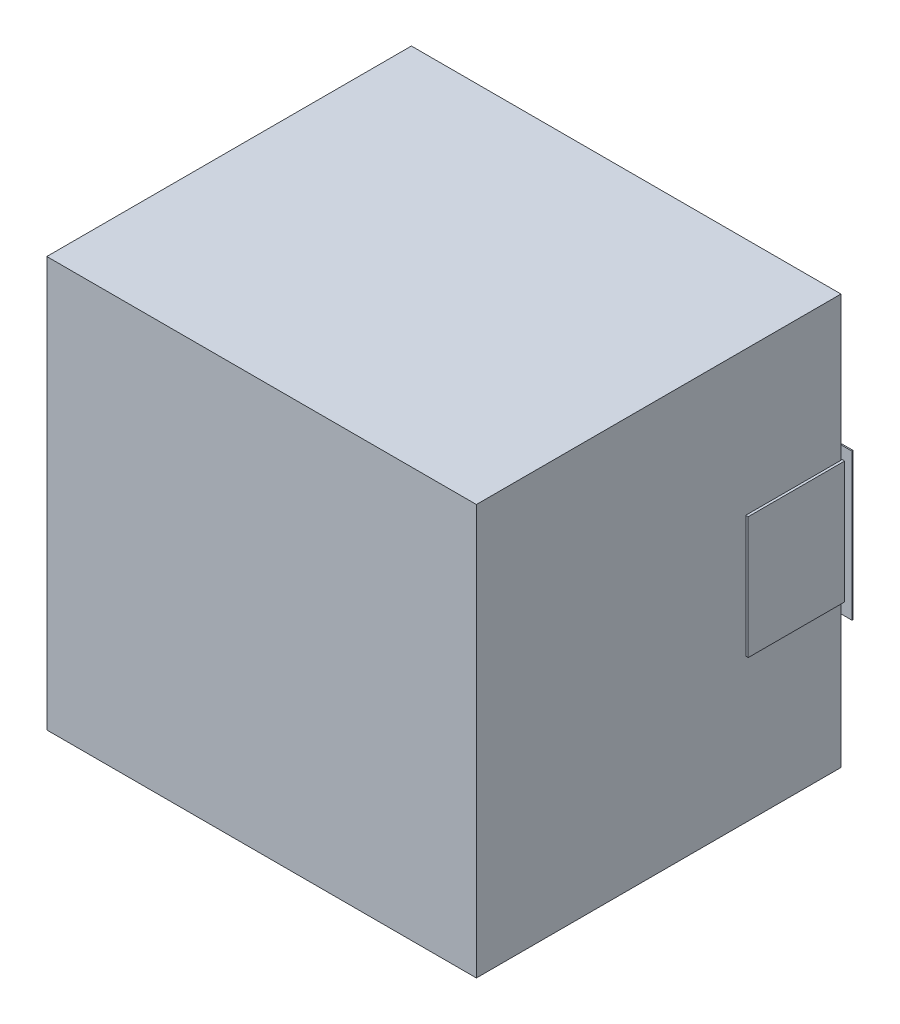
ISO-10303-21;
HEADER;
FILE_DESCRIPTION(('STEP AP214'),'2;1');
FILE_NAME('part.step','',(''),(''),'','','');
FILE_SCHEMA(('AUTOMOTIVE_DESIGN { 1 0 10303 214 1 1 1 1 }'));
ENDSEC;
DATA;
#1=APPLICATION_CONTEXT('core data for automotive mechanical design processes');
#2=APPLICATION_PROTOCOL_DEFINITION('international standard','automotive_design',2000,#1);
#3=PRODUCT_CONTEXT('',#1,'mechanical');
#4=PRODUCT('Part','Part','',(#3));
#5=PRODUCT_RELATED_PRODUCT_CATEGORY('part','',(#4));
#6=PRODUCT_DEFINITION_FORMATION('','',#4);
#7=PRODUCT_DEFINITION_CONTEXT('part definition',#1,'design');
#8=PRODUCT_DEFINITION('design','',#6,#7);
#9=PRODUCT_DEFINITION_SHAPE('','',#8);
#10=(LENGTH_UNIT() NAMED_UNIT(*) SI_UNIT(.MILLI.,.METRE.));
#11=(NAMED_UNIT(*) PLANE_ANGLE_UNIT() SI_UNIT($,.RADIAN.));
#12=(NAMED_UNIT(*) SI_UNIT($,.STERADIAN.) SOLID_ANGLE_UNIT());
#13=UNCERTAINTY_MEASURE_WITH_UNIT(LENGTH_MEASURE(1.E-05),#10,'distance_accuracy_value','');
#14=(GEOMETRIC_REPRESENTATION_CONTEXT(3) GLOBAL_UNCERTAINTY_ASSIGNED_CONTEXT((#13)) GLOBAL_UNIT_ASSIGNED_CONTEXT((#10,
#11,#12)) REPRESENTATION_CONTEXT('',''));
#15=CARTESIAN_POINT('',(0.,0.,0.));
#16=DIRECTION('',(0.,0.,1.));
#17=DIRECTION('',(1.,0.,0.));
#18=AXIS2_PLACEMENT_3D('',#15,#16,#17);
#19=CARTESIAN_POINT('',(0.,0.,0.0762));
#20=DIRECTION('',(0.,0.,-1.));
#21=DIRECTION('',(-1.,0.,0.));
#22=AXIS2_PLACEMENT_3D('',#19,#20,#21);
#23=PLANE('',#22);
#24=DIRECTION('',(1.,0.,0.));
#25=VECTOR('',#24,1.);
#26=CARTESIAN_POINT('',(-2.20000000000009,-1.5000000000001,0.0762));
#27=LINE('',#26,#25);
#28=CARTESIAN_POINT('',(-4.59999999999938,-1.5000000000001,0.0762));
#29=VERTEX_POINT('',#28);
#30=CARTESIAN_POINT('',(-2.20000000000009,-1.5000000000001,0.0762));
#31=VERTEX_POINT('',#30);
#32=EDGE_CURVE('E179',#29,#31,#27,.T.);
#33=ORIENTED_EDGE('',*,*,#32,.F.);
#34=DIRECTION('',(0.,1.,0.));
#35=VECTOR('',#34,1.);
#36=CARTESIAN_POINT('',(-4.59999999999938,-1.5000000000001,0.0762));
#37=LINE('',#36,#35);
#38=CARTESIAN_POINT('',(-4.59999999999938,1.5000000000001,0.0762));
#39=VERTEX_POINT('',#38);
#40=EDGE_CURVE('E19',#39,#29,#37,.F.);
#41=ORIENTED_EDGE('',*,*,#40,.F.);
#42=DIRECTION('',(1.,0.,0.));
#43=VECTOR('',#42,1.);
#44=CARTESIAN_POINT('',(-4.59999999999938,1.5000000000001,0.0762));
#45=LINE('',#44,#43);
#46=CARTESIAN_POINT('',(-2.20000000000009,1.5000000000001,0.0762));
#47=VERTEX_POINT('',#46);
#48=EDGE_CURVE('E174',#47,#39,#45,.F.);
#49=ORIENTED_EDGE('',*,*,#48,.F.);
#50=DIRECTION('',(0.,1.,0.));
#51=VECTOR('',#50,1.);
#52=CARTESIAN_POINT('',(-2.20000000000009,1.5000000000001,0.0762));
#53=LINE('',#52,#51);
#54=EDGE_CURVE('E194',#31,#47,#53,.T.);
#55=ORIENTED_EDGE('',*,*,#54,.F.);
#56=EDGE_LOOP('',(#33,#41,#49,#55));
#57=FACE_BOUND('',#56,.T.);
#58=ADVANCED_FACE('F16',(#57),#23,.T.);
#59=CARTESIAN_POINT('',(0.,0.,0.0762));
#60=DIRECTION('',(0.,0.,-1.));
#61=DIRECTION('',(-1.,0.,0.));
#62=AXIS2_PLACEMENT_3D('',#59,#60,#61);
#63=PLANE('',#62);
#64=DIRECTION('',(1.,0.,0.));
#65=VECTOR('',#64,1.);
#66=CARTESIAN_POINT('',(4.59999999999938,-1.5000000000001,0.0762));
#67=LINE('',#66,#65);
#68=CARTESIAN_POINT('',(2.20000000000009,-1.5000000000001,0.0762));
#69=VERTEX_POINT('',#68);
#70=CARTESIAN_POINT('',(4.59999999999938,-1.5000000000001,0.0762));
#71=VERTEX_POINT('',#70);
#72=EDGE_CURVE('E224',#69,#71,#67,.T.);
#73=ORIENTED_EDGE('',*,*,#72,.F.);
#74=DIRECTION('',(0.,1.,0.));
#75=VECTOR('',#74,1.);
#76=CARTESIAN_POINT('',(2.20000000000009,-1.5000000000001,0.0762));
#77=LINE('',#76,#75);
#78=CARTESIAN_POINT('',(2.20000000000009,1.5000000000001,0.0762));
#79=VERTEX_POINT('',#78);
#80=EDGE_CURVE('E204',#79,#69,#77,.F.);
#81=ORIENTED_EDGE('',*,*,#80,.F.);
#82=DIRECTION('',(1.,0.,0.));
#83=VECTOR('',#82,1.);
#84=CARTESIAN_POINT('',(2.20000000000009,1.5000000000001,0.0762));
#85=LINE('',#84,#83);
#86=CARTESIAN_POINT('',(4.59999999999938,1.5000000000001,0.0762));
#87=VERTEX_POINT('',#86);
#88=EDGE_CURVE('E209',#87,#79,#85,.F.);
#89=ORIENTED_EDGE('',*,*,#88,.F.);
#90=DIRECTION('',(0.,1.,0.));
#91=VECTOR('',#90,1.);
#92=CARTESIAN_POINT('',(4.59999999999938,1.5000000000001,0.0762));
#93=LINE('',#92,#91);
#94=EDGE_CURVE('E215',#71,#87,#93,.T.);
#95=ORIENTED_EDGE('',*,*,#94,.F.);
#96=EDGE_LOOP('',(#73,#81,#89,#95));
#97=FACE_BOUND('',#96,.T.);
#98=ADVANCED_FACE('F504',(#97),#63,.T.);
#99=CARTESIAN_POINT('',(-4.59999999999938,-1.5000000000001,0.0762));
#100=DIRECTION('',(-1.,0.,0.));
#101=DIRECTION('',(0.,0.,1.));
#102=AXIS2_PLACEMENT_3D('',#99,#100,#101);
#103=PLANE('',#102);
#104=DIRECTION('',(0.,0.,1.));
#105=VECTOR('',#104,1.);
#106=CARTESIAN_POINT('',(-4.59999999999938,1.5000000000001,0.0762));
#107=LINE('',#106,#105);
#108=CARTESIAN_POINT('',(-4.59999999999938,1.5000000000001,0.101200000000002));
#109=VERTEX_POINT('',#108);
#110=EDGE_CURVE('E182',#39,#109,#107,.T.);
#111=ORIENTED_EDGE('',*,*,#110,.F.);
#112=ORIENTED_EDGE('',*,*,#40,.T.);
#113=DIRECTION('',(0.,0.,-1.));
#114=VECTOR('',#113,1.);
#115=CARTESIAN_POINT('',(-4.59999999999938,-1.5000000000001,0.0762));
#116=LINE('',#115,#114);
#117=CARTESIAN_POINT('',(-4.59999999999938,-1.5000000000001,0.101200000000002));
#118=VERTEX_POINT('',#117);
#119=EDGE_CURVE('E201',#118,#29,#116,.T.);
#120=ORIENTED_EDGE('',*,*,#119,.F.);
#121=DIRECTION('',(0.,1.,0.));
#122=VECTOR('',#121,1.);
#123=CARTESIAN_POINT('',(-4.59999999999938,0.,0.101200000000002));
#124=LINE('',#123,#122);
#125=EDGE_CURVE('E186',#118,#109,#124,.T.);
#126=ORIENTED_EDGE('',*,*,#125,.T.);
#127=EDGE_LOOP('',(#111,#112,#120,#126));
#128=FACE_BOUND('',#127,.T.);
#129=ADVANCED_FACE('F184',(#128),#103,.T.);
#130=CARTESIAN_POINT('',(-4.59999999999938,1.5000000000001,0.0762));
#131=DIRECTION('',(0.,1.,0.));
#132=DIRECTION('',(0.,0.,1.));
#133=AXIS2_PLACEMENT_3D('',#130,#131,#132);
#134=PLANE('',#133);
#135=DIRECTION('',(0.,0.,-1.));
#136=VECTOR('',#135,1.);
#137=CARTESIAN_POINT('',(-2.20000000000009,1.5000000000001,0.0762));
#138=LINE('',#137,#136);
#139=CARTESIAN_POINT('',(-2.20000000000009,1.5000000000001,0.101200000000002));
#140=VERTEX_POINT('',#139);
#141=EDGE_CURVE('E191',#47,#140,#138,.F.);
#142=ORIENTED_EDGE('',*,*,#141,.F.);
#143=ORIENTED_EDGE('',*,*,#48,.T.);
#144=ORIENTED_EDGE('',*,*,#110,.T.);
#145=DIRECTION('',(-1.,0.,0.));
#146=VECTOR('',#145,1.);
#147=CARTESIAN_POINT('',(0.,1.5000000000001,0.101200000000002));
#148=LINE('',#147,#146);
#149=EDGE_CURVE('E228',#109,#140,#148,.F.);
#150=ORIENTED_EDGE('',*,*,#149,.T.);
#151=EDGE_LOOP('',(#142,#143,#144,#150));
#152=FACE_BOUND('',#151,.T.);
#153=ADVANCED_FACE('F189',(#152),#134,.T.);
#154=CARTESIAN_POINT('',(-2.20000000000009,1.5000000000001,0.0762));
#155=DIRECTION('',(1.,0.,0.));
#156=DIRECTION('',(0.,0.,-1.));
#157=AXIS2_PLACEMENT_3D('',#154,#155,#156);
#158=PLANE('',#157);
#159=DIRECTION('',(0.,0.,-1.));
#160=VECTOR('',#159,1.);
#161=CARTESIAN_POINT('',(-2.20000000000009,-1.5000000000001,0.0762));
#162=LINE('',#161,#160);
#163=CARTESIAN_POINT('',(-2.20000000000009,-1.5000000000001,0.101200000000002));
#164=VERTEX_POINT('',#163);
#165=EDGE_CURVE('E198',#31,#164,#162,.F.);
#166=ORIENTED_EDGE('',*,*,#165,.F.);
#167=ORIENTED_EDGE('',*,*,#54,.T.);
#168=ORIENTED_EDGE('',*,*,#141,.T.);
#169=DIRECTION('',(0.,1.,0.));
#170=VECTOR('',#169,1.);
#171=CARTESIAN_POINT('',(-2.20000000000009,0.,0.101200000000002));
#172=LINE('',#171,#170);
#173=EDGE_CURVE('E230',#140,#164,#172,.F.);
#174=ORIENTED_EDGE('',*,*,#173,.T.);
#175=EDGE_LOOP('',(#166,#167,#168,#174));
#176=FACE_BOUND('',#175,.T.);
#177=ADVANCED_FACE('F430',(#176),#158,.T.);
#178=CARTESIAN_POINT('',(-2.20000000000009,-1.5000000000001,0.0762));
#179=DIRECTION('',(0.,-1.,0.));
#180=DIRECTION('',(0.,0.,-1.));
#181=AXIS2_PLACEMENT_3D('',#178,#179,#180);
#182=PLANE('',#181);
#183=ORIENTED_EDGE('',*,*,#119,.T.);
#184=ORIENTED_EDGE('',*,*,#32,.T.);
#185=ORIENTED_EDGE('',*,*,#165,.T.);
#186=DIRECTION('',(-1.,0.,0.));
#187=VECTOR('',#186,1.);
#188=CARTESIAN_POINT('',(0.,-1.5000000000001,0.101200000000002));
#189=LINE('',#188,#187);
#190=EDGE_CURVE('E232',#164,#118,#189,.T.);
#191=ORIENTED_EDGE('',*,*,#190,.T.);
#192=EDGE_LOOP('',(#183,#184,#185,#191));
#193=FACE_BOUND('',#192,.T.);
#194=ADVANCED_FACE('F432',(#193),#182,.T.);
#195=CARTESIAN_POINT('',(2.20000000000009,-1.5000000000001,0.0762));
#196=DIRECTION('',(-1.,0.,0.));
#197=DIRECTION('',(0.,0.,1.));
#198=AXIS2_PLACEMENT_3D('',#195,#196,#197);
#199=PLANE('',#198);
#200=DIRECTION('',(0.,0.,1.));
#201=VECTOR('',#200,1.);
#202=CARTESIAN_POINT('',(2.20000000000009,1.5000000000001,0.0762));
#203=LINE('',#202,#201);
#204=CARTESIAN_POINT('',(2.20000000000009,1.5000000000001,0.101200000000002));
#205=VERTEX_POINT('',#204);
#206=EDGE_CURVE('E206',#79,#205,#203,.T.);
#207=ORIENTED_EDGE('',*,*,#206,.F.);
#208=ORIENTED_EDGE('',*,*,#80,.T.);
#209=DIRECTION('',(0.,0.,-1.));
#210=VECTOR('',#209,1.);
#211=CARTESIAN_POINT('',(2.20000000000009,-1.5000000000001,0.0762));
#212=LINE('',#211,#210);
#213=CARTESIAN_POINT('',(2.20000000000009,-1.5000000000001,0.101200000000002));
#214=VERTEX_POINT('',#213);
#215=EDGE_CURVE('E221',#214,#69,#212,.T.);
#216=ORIENTED_EDGE('',*,*,#215,.F.);
#217=DIRECTION('',(0.,1.,0.));
#218=VECTOR('',#217,1.);
#219=CARTESIAN_POINT('',(2.20000000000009,0.,0.101200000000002));
#220=LINE('',#219,#218);
#221=EDGE_CURVE('E239',#214,#205,#220,.T.);
#222=ORIENTED_EDGE('',*,*,#221,.T.);
#223=EDGE_LOOP('',(#207,#208,#216,#222));
#224=FACE_BOUND('',#223,.T.);
#225=ADVANCED_FACE('F434',(#224),#199,.T.);
#226=CARTESIAN_POINT('',(2.20000000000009,1.5000000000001,0.0762));
#227=DIRECTION('',(0.,1.,0.));
#228=DIRECTION('',(0.,0.,1.));
#229=AXIS2_PLACEMENT_3D('',#226,#227,#228);
#230=PLANE('',#229);
#231=DIRECTION('',(0.,0.,-1.));
#232=VECTOR('',#231,1.);
#233=CARTESIAN_POINT('',(4.59999999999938,1.5000000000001,0.0762));
#234=LINE('',#233,#232);
#235=CARTESIAN_POINT('',(4.59999999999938,1.5000000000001,0.101200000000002));
#236=VERTEX_POINT('',#235);
#237=EDGE_CURVE('E212',#87,#236,#234,.F.);
#238=ORIENTED_EDGE('',*,*,#237,.F.);
#239=ORIENTED_EDGE('',*,*,#88,.T.);
#240=ORIENTED_EDGE('',*,*,#206,.T.);
#241=DIRECTION('',(-1.,0.,0.));
#242=VECTOR('',#241,1.);
#243=CARTESIAN_POINT('',(0.,1.5000000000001,0.101200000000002));
#244=LINE('',#243,#242);
#245=EDGE_CURVE('E241',#205,#236,#244,.F.);
#246=ORIENTED_EDGE('',*,*,#245,.T.);
#247=EDGE_LOOP('',(#238,#239,#240,#246));
#248=FACE_BOUND('',#247,.T.);
#249=ADVANCED_FACE('F441',(#248),#230,.T.);
#250=CARTESIAN_POINT('',(4.59999999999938,1.5000000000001,0.0762));
#251=DIRECTION('',(1.,0.,0.));
#252=DIRECTION('',(0.,0.,-1.));
#253=AXIS2_PLACEMENT_3D('',#250,#251,#252);
#254=PLANE('',#253);
#255=DIRECTION('',(0.,0.,-1.));
#256=VECTOR('',#255,1.);
#257=CARTESIAN_POINT('',(4.59999999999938,-1.5000000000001,0.0762));
#258=LINE('',#257,#256);
#259=CARTESIAN_POINT('',(4.59999999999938,-1.5000000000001,0.101200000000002));
#260=VERTEX_POINT('',#259);
#261=EDGE_CURVE('E218',#71,#260,#258,.F.);
#262=ORIENTED_EDGE('',*,*,#261,.F.);
#263=ORIENTED_EDGE('',*,*,#94,.T.);
#264=ORIENTED_EDGE('',*,*,#237,.T.);
#265=DIRECTION('',(0.,1.,0.));
#266=VECTOR('',#265,1.);
#267=CARTESIAN_POINT('',(4.59999999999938,0.,0.101200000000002));
#268=LINE('',#267,#266);
#269=EDGE_CURVE('E243',#236,#260,#268,.F.);
#270=ORIENTED_EDGE('',*,*,#269,.T.);
#271=EDGE_LOOP('',(#262,#263,#264,#270));
#272=FACE_BOUND('',#271,.T.);
#273=ADVANCED_FACE('F489',(#272),#254,.T.);
#274=CARTESIAN_POINT('',(4.59999999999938,-1.5000000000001,0.0762));
#275=DIRECTION('',(0.,-1.,0.));
#276=DIRECTION('',(0.,0.,-1.));
#277=AXIS2_PLACEMENT_3D('',#274,#275,#276);
#278=PLANE('',#277);
#279=ORIENTED_EDGE('',*,*,#215,.T.);
#280=ORIENTED_EDGE('',*,*,#72,.T.);
#281=ORIENTED_EDGE('',*,*,#261,.T.);
#282=DIRECTION('',(-1.,0.,0.));
#283=VECTOR('',#282,1.);
#284=CARTESIAN_POINT('',(0.,-1.5000000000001,0.101200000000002));
#285=LINE('',#284,#283);
#286=EDGE_CURVE('E245',#260,#214,#285,.T.);
#287=ORIENTED_EDGE('',*,*,#286,.T.);
#288=EDGE_LOOP('',(#279,#280,#281,#287));
#289=FACE_BOUND('',#288,.T.);
#290=ADVANCED_FACE('F424',(#289),#278,.T.);
#291=CARTESIAN_POINT('',(0.,0.,0.101200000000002));
#292=DIRECTION('',(0.,0.,-1.));
#293=DIRECTION('',(-1.,0.,0.));
#294=AXIS2_PLACEMENT_3D('',#291,#292,#293);
#295=PLANE('',#294);
#296=DIRECTION('',(0.,1.,0.));
#297=VECTOR('',#296,1.);
#298=CARTESIAN_POINT('',(-2.74999999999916,1.25000000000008,0.101200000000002));
#299=LINE('',#298,#297);
#300=CARTESIAN_POINT('',(-2.74999999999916,-1.25000000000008,0.101200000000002));
#301=VERTEX_POINT('',#300);
#302=CARTESIAN_POINT('',(-2.74999999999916,1.25000000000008,0.101200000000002));
#303=VERTEX_POINT('',#302);
#304=EDGE_CURVE('E258',#301,#303,#299,.T.);
#305=ORIENTED_EDGE('',*,*,#304,.F.);
#306=DIRECTION('',(-1.,0.,0.));
#307=VECTOR('',#306,1.);
#308=CARTESIAN_POINT('',(0.,-1.25000000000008,0.101200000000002));
#309=LINE('',#308,#307);
#310=CARTESIAN_POINT('',(-4.44999999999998,-1.25000000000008,0.101200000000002));
#311=VERTEX_POINT('',#310);
#312=EDGE_CURVE('E235',#311,#301,#309,.F.);
#313=ORIENTED_EDGE('',*,*,#312,.F.);
#314=DIRECTION('',(0.,1.,0.));
#315=VECTOR('',#314,1.);
#316=CARTESIAN_POINT('',(-4.44999999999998,-1.25000000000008,0.101200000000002));
#317=LINE('',#316,#315);
#318=CARTESIAN_POINT('',(-4.44999999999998,1.25000000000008,0.101200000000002));
#319=VERTEX_POINT('',#318);
#320=EDGE_CURVE('E252',#319,#311,#317,.F.);
#321=ORIENTED_EDGE('',*,*,#320,.F.);
#322=DIRECTION('',(-1.,0.,0.));
#323=VECTOR('',#322,1.);
#324=CARTESIAN_POINT('',(0.,1.25000000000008,0.101200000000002));
#325=LINE('',#324,#323);
#326=EDGE_CURVE('E237',#303,#319,#325,.T.);
#327=ORIENTED_EDGE('',*,*,#326,.F.);
#328=EDGE_LOOP('',(#305,#313,#321,#327));
#329=FACE_BOUND('',#328,.T.);
#330=ORIENTED_EDGE('',*,*,#173,.F.);
#331=ORIENTED_EDGE('',*,*,#149,.F.);
#332=ORIENTED_EDGE('',*,*,#125,.F.);
#333=ORIENTED_EDGE('',*,*,#190,.F.);
#334=EDGE_LOOP('',(#330,#331,#332,#333));
#335=FACE_BOUND('',#334,.T.);
#336=ADVANCED_FACE('F420',(#329,#335),#295,.F.);
#337=CARTESIAN_POINT('',(0.,0.,0.101200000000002));
#338=DIRECTION('',(0.,0.,-1.));
#339=DIRECTION('',(-1.,0.,0.));
#340=AXIS2_PLACEMENT_3D('',#337,#338,#339);
#341=PLANE('',#340);
#342=DIRECTION('',(-1.,0.,0.));
#343=VECTOR('',#342,1.);
#344=CARTESIAN_POINT('',(0.,1.25000000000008,0.101200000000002));
#345=LINE('',#344,#343);
#346=CARTESIAN_POINT('',(4.44999999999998,1.25000000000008,0.101200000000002));
#347=VERTEX_POINT('',#346);
#348=CARTESIAN_POINT('',(2.74999999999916,1.25000000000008,0.101200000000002));
#349=VERTEX_POINT('',#348);
#350=EDGE_CURVE('E250',#347,#349,#345,.T.);
#351=ORIENTED_EDGE('',*,*,#350,.F.);
#352=DIRECTION('',(0.,1.,0.));
#353=VECTOR('',#352,1.);
#354=CARTESIAN_POINT('',(4.44999999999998,1.25000000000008,0.101200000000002));
#355=LINE('',#354,#353);
#356=CARTESIAN_POINT('',(4.44999999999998,-1.25000000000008,0.101200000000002));
#357=VERTEX_POINT('',#356);
#358=EDGE_CURVE('E255',#357,#347,#355,.T.);
#359=ORIENTED_EDGE('',*,*,#358,.F.);
#360=DIRECTION('',(-1.,0.,0.));
#361=VECTOR('',#360,1.);
#362=CARTESIAN_POINT('',(0.,-1.25000000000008,0.101200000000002));
#363=LINE('',#362,#361);
#364=CARTESIAN_POINT('',(2.74999999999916,-1.25000000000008,0.101200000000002));
#365=VERTEX_POINT('',#364);
#366=EDGE_CURVE('E248',#365,#357,#363,.F.);
#367=ORIENTED_EDGE('',*,*,#366,.F.);
#368=DIRECTION('',(0.,1.,0.));
#369=VECTOR('',#368,1.);
#370=CARTESIAN_POINT('',(2.74999999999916,-1.25000000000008,0.101200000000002));
#371=LINE('',#370,#369);
#372=EDGE_CURVE('E261',#349,#365,#371,.F.);
#373=ORIENTED_EDGE('',*,*,#372,.F.);
#374=EDGE_LOOP('',(#351,#359,#367,#373));
#375=FACE_BOUND('',#374,.T.);
#376=ORIENTED_EDGE('',*,*,#269,.F.);
#377=ORIENTED_EDGE('',*,*,#245,.F.);
#378=ORIENTED_EDGE('',*,*,#221,.F.);
#379=ORIENTED_EDGE('',*,*,#286,.F.);
#380=EDGE_LOOP('',(#376,#377,#378,#379));
#381=FACE_BOUND('',#380,.T.);
#382=ADVANCED_FACE('F423',(#375,#381),#341,.F.);
#383=CARTESIAN_POINT('',(-4.44999999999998,-1.25000000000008,0.0762));
#384=DIRECTION('',(-1.,0.,0.));
#385=DIRECTION('',(0.,0.,1.));
#386=AXIS2_PLACEMENT_3D('',#383,#384,#385);
#387=PLANE('',#386);
#388=DIRECTION('',(0.,0.,1.));
#389=VECTOR('',#388,1.);
#390=CARTESIAN_POINT('',(-4.44999999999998,1.25000000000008,0.0762));
#391=LINE('',#390,#389);
#392=CARTESIAN_POINT('',(-4.44999999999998,1.25000000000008,2.07619999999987));
#393=VERTEX_POINT('',#392);
#394=EDGE_CURVE('E270',#319,#393,#391,.T.);
#395=ORIENTED_EDGE('',*,*,#394,.F.);
#396=ORIENTED_EDGE('',*,*,#320,.T.);
#397=DIRECTION('',(0.,0.,-1.));
#398=VECTOR('',#397,1.);
#399=CARTESIAN_POINT('',(-4.44999999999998,-1.25000000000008,0.0762));
#400=LINE('',#399,#398);
#401=CARTESIAN_POINT('',(-4.44999999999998,-1.25000000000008,2.07619999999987));
#402=VERTEX_POINT('',#401);
#403=EDGE_CURVE('E267',#402,#311,#400,.T.);
#404=ORIENTED_EDGE('',*,*,#403,.F.);
#405=DIRECTION('',(0.,1.,0.));
#406=VECTOR('',#405,1.);
#407=CARTESIAN_POINT('',(-4.44999999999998,0.,2.07619999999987));
#408=LINE('',#407,#406);
#409=EDGE_CURVE('E279',#402,#393,#408,.T.);
#410=ORIENTED_EDGE('',*,*,#409,.T.);
#411=EDGE_LOOP('',(#395,#396,#404,#410));
#412=FACE_BOUND('',#411,.T.);
#413=ADVANCED_FACE('F417',(#412),#387,.T.);
#414=CARTESIAN_POINT('',(4.44999999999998,1.25000000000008,0.0762));
#415=DIRECTION('',(1.,0.,0.));
#416=DIRECTION('',(0.,0.,-1.));
#417=AXIS2_PLACEMENT_3D('',#414,#415,#416);
#418=PLANE('',#417);
#419=DIRECTION('',(0.,0.,-1.));
#420=VECTOR('',#419,1.);
#421=CARTESIAN_POINT('',(4.44999999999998,-1.25000000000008,0.0762));
#422=LINE('',#421,#420);
#423=CARTESIAN_POINT('',(4.44999999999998,-1.25000000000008,2.07619999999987));
#424=VERTEX_POINT('',#423);
#425=EDGE_CURVE('E289',#357,#424,#422,.F.);
#426=ORIENTED_EDGE('',*,*,#425,.F.);
#427=ORIENTED_EDGE('',*,*,#358,.T.);
#428=DIRECTION('',(0.,0.,1.));
#429=VECTOR('',#428,1.);
#430=CARTESIAN_POINT('',(4.44999999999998,1.25000000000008,0.0762));
#431=LINE('',#430,#429);
#432=CARTESIAN_POINT('',(4.44999999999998,1.25000000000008,2.07619999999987));
#433=VERTEX_POINT('',#432);
#434=EDGE_CURVE('E286',#433,#347,#431,.F.);
#435=ORIENTED_EDGE('',*,*,#434,.F.);
#436=DIRECTION('',(0.,1.,0.));
#437=VECTOR('',#436,1.);
#438=CARTESIAN_POINT('',(4.44999999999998,0.,2.07619999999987));
#439=LINE('',#438,#437);
#440=EDGE_CURVE('E298',#433,#424,#439,.F.);
#441=ORIENTED_EDGE('',*,*,#440,.T.);
#442=EDGE_LOOP('',(#426,#427,#435,#441));
#443=FACE_BOUND('',#442,.T.);
#444=ADVANCED_FACE('F478',(#443),#418,.T.);
#445=CARTESIAN_POINT('',(-2.74999999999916,1.25000000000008,0.0762));
#446=DIRECTION('',(1.,0.,0.));
#447=DIRECTION('',(0.,0.,-1.));
#448=AXIS2_PLACEMENT_3D('',#445,#446,#447);
#449=PLANE('',#448);
#450=DIRECTION('',(0.,0.,-1.));
#451=VECTOR('',#450,1.);
#452=CARTESIAN_POINT('',(-2.74999999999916,-1.25000000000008,0.0762));
#453=LINE('',#452,#451);
#454=CARTESIAN_POINT('',(-2.74999999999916,-1.25000000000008,0.126200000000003));
#455=VERTEX_POINT('',#454);
#456=EDGE_CURVE('E264',#301,#455,#453,.F.);
#457=ORIENTED_EDGE('',*,*,#456,.F.);
#458=ORIENTED_EDGE('',*,*,#304,.T.);
#459=DIRECTION('',(0.,0.,1.));
#460=VECTOR('',#459,1.);
#461=CARTESIAN_POINT('',(-2.74999999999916,1.25000000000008,0.0762));
#462=LINE('',#461,#460);
#463=CARTESIAN_POINT('',(-2.74999999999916,1.25000000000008,0.126200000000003));
#464=VERTEX_POINT('',#463);
#465=EDGE_CURVE('E273',#464,#303,#462,.F.);
#466=ORIENTED_EDGE('',*,*,#465,.F.);
#467=DIRECTION('',(0.,1.,0.));
#468=VECTOR('',#467,1.);
#469=CARTESIAN_POINT('',(-2.74999999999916,0.,0.126200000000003));
#470=LINE('',#469,#468);
#471=EDGE_CURVE('E305',#464,#455,#470,.F.);
#472=ORIENTED_EDGE('',*,*,#471,.T.);
#473=EDGE_LOOP('',(#457,#458,#466,#472));
#474=FACE_BOUND('',#473,.T.);
#475=ADVANCED_FACE('F406',(#474),#449,.T.);
#476=CARTESIAN_POINT('',(2.74999999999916,-1.25000000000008,0.0762));
#477=DIRECTION('',(-1.,0.,0.));
#478=DIRECTION('',(0.,0.,1.));
#479=AXIS2_PLACEMENT_3D('',#476,#477,#478);
#480=PLANE('',#479);
#481=DIRECTION('',(0.,0.,1.));
#482=VECTOR('',#481,1.);
#483=CARTESIAN_POINT('',(2.74999999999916,1.25000000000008,0.0762));
#484=LINE('',#483,#482);
#485=CARTESIAN_POINT('',(2.74999999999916,1.25000000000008,0.126200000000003));
#486=VERTEX_POINT('',#485);
#487=EDGE_CURVE('E283',#349,#486,#484,.T.);
#488=ORIENTED_EDGE('',*,*,#487,.F.);
#489=ORIENTED_EDGE('',*,*,#372,.T.);
#490=DIRECTION('',(0.,0.,-1.));
#491=VECTOR('',#490,1.);
#492=CARTESIAN_POINT('',(2.74999999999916,-1.25000000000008,0.0762));
#493=LINE('',#492,#491);
#494=CARTESIAN_POINT('',(2.74999999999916,-1.25000000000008,0.126200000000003));
#495=VERTEX_POINT('',#494);
#496=EDGE_CURVE('E292',#495,#365,#493,.T.);
#497=ORIENTED_EDGE('',*,*,#496,.F.);
#498=DIRECTION('',(0.,1.,0.));
#499=VECTOR('',#498,1.);
#500=CARTESIAN_POINT('',(2.74999999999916,0.,0.126200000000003));
#501=LINE('',#500,#499);
#502=EDGE_CURVE('E312',#495,#486,#501,.T.);
#503=ORIENTED_EDGE('',*,*,#502,.T.);
#504=EDGE_LOOP('',(#488,#489,#497,#503));
#505=FACE_BOUND('',#504,.T.);
#506=ADVANCED_FACE('F472',(#505),#480,.T.);
#507=CARTESIAN_POINT('',(-2.74999999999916,-1.25000000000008,0.0762));
#508=DIRECTION('',(0.,-1.,0.));
#509=DIRECTION('',(0.,0.,-1.));
#510=AXIS2_PLACEMENT_3D('',#507,#508,#509);
#511=PLANE('',#510);
#512=ORIENTED_EDGE('',*,*,#403,.T.);
#513=ORIENTED_EDGE('',*,*,#312,.T.);
#514=ORIENTED_EDGE('',*,*,#456,.T.);
#515=DIRECTION('',(1.,0.,0.));
#516=VECTOR('',#515,1.);
#517=CARTESIAN_POINT('',(0.,-1.25000000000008,0.126200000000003));
#518=LINE('',#517,#516);
#519=CARTESIAN_POINT('',(-4.40000000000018,-1.25000000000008,0.126200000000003));
#520=VERTEX_POINT('',#519);
#521=EDGE_CURVE('E307',#455,#520,#518,.F.);
#522=ORIENTED_EDGE('',*,*,#521,.T.);
#523=DIRECTION('',(0.,0.,1.));
#524=VECTOR('',#523,1.);
#525=CARTESIAN_POINT('',(-4.40000000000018,-1.25000000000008,0.0762));
#526=LINE('',#525,#524);
#527=CARTESIAN_POINT('',(-4.40000000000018,-1.25000000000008,2.07619999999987));
#528=VERTEX_POINT('',#527);
#529=EDGE_CURVE('E316',#528,#520,#526,.F.);
#530=ORIENTED_EDGE('',*,*,#529,.F.);
#531=DIRECTION('',(-1.,0.,0.));
#532=VECTOR('',#531,1.);
#533=CARTESIAN_POINT('',(0.,-1.25000000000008,2.07619999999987));
#534=LINE('',#533,#532);
#535=EDGE_CURVE('E276',#528,#402,#534,.T.);
#536=ORIENTED_EDGE('',*,*,#535,.T.);
#537=EDGE_LOOP('',(#512,#513,#514,#522,#530,#536));
#538=FACE_BOUND('',#537,.T.);
#539=ADVANCED_FACE('F401',(#538),#511,.T.);
#540=CARTESIAN_POINT('',(-4.44999999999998,1.25000000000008,0.0762));
#541=DIRECTION('',(0.,1.,0.));
#542=DIRECTION('',(0.,0.,1.));
#543=AXIS2_PLACEMENT_3D('',#540,#541,#542);
#544=PLANE('',#543);
#545=ORIENTED_EDGE('',*,*,#465,.T.);
#546=ORIENTED_EDGE('',*,*,#326,.T.);
#547=ORIENTED_EDGE('',*,*,#394,.T.);
#548=DIRECTION('',(-1.,0.,0.));
#549=VECTOR('',#548,1.);
#550=CARTESIAN_POINT('',(0.,1.25000000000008,2.07619999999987));
#551=LINE('',#550,#549);
#552=CARTESIAN_POINT('',(-4.40000000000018,1.25000000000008,2.07619999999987));
#553=VERTEX_POINT('',#552);
#554=EDGE_CURVE('E281',#393,#553,#551,.F.);
#555=ORIENTED_EDGE('',*,*,#554,.T.);
#556=DIRECTION('',(0.,0.,1.));
#557=VECTOR('',#556,1.);
#558=CARTESIAN_POINT('',(-4.40000000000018,1.25000000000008,0.0762));
#559=LINE('',#558,#557);
#560=CARTESIAN_POINT('',(-4.40000000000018,1.25000000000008,0.126200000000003));
#561=VERTEX_POINT('',#560);
#562=EDGE_CURVE('E324',#561,#553,#559,.T.);
#563=ORIENTED_EDGE('',*,*,#562,.F.);
#564=DIRECTION('',(1.,0.,0.));
#565=VECTOR('',#564,1.);
#566=CARTESIAN_POINT('',(0.,1.25000000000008,0.126200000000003));
#567=LINE('',#566,#565);
#568=EDGE_CURVE('E302',#561,#464,#567,.T.);
#569=ORIENTED_EDGE('',*,*,#568,.T.);
#570=EDGE_LOOP('',(#545,#546,#547,#555,#563,#569));
#571=FACE_BOUND('',#570,.T.);
#572=ADVANCED_FACE('F409',(#571),#544,.T.);
#573=CARTESIAN_POINT('',(0.,0.,2.07619999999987));
#574=DIRECTION('',(0.,0.,-1.));
#575=DIRECTION('',(-1.,0.,0.));
#576=AXIS2_PLACEMENT_3D('',#573,#574,#575);
#577=PLANE('',#576);
#578=ORIENTED_EDGE('',*,*,#409,.F.);
#579=ORIENTED_EDGE('',*,*,#535,.F.);
#580=DIRECTION('',(0.,1.,0.));
#581=VECTOR('',#580,1.);
#582=CARTESIAN_POINT('',(-4.40000000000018,4.20000000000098,2.07619999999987));
#583=LINE('',#582,#581);
#584=EDGE_CURVE('E327',#553,#528,#583,.F.);
#585=ORIENTED_EDGE('',*,*,#584,.F.);
#586=ORIENTED_EDGE('',*,*,#554,.F.);
#587=EDGE_LOOP('',(#578,#579,#585,#586));
#588=FACE_BOUND('',#587,.T.);
#589=ADVANCED_FACE('F414',(#588),#577,.F.);
#590=CARTESIAN_POINT('',(2.74999999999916,1.25000000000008,0.0762));
#591=DIRECTION('',(0.,1.,0.));
#592=DIRECTION('',(0.,0.,1.));
#593=AXIS2_PLACEMENT_3D('',#590,#591,#592);
#594=PLANE('',#593);
#595=ORIENTED_EDGE('',*,*,#434,.T.);
#596=ORIENTED_EDGE('',*,*,#350,.T.);
#597=ORIENTED_EDGE('',*,*,#487,.T.);
#598=DIRECTION('',(1.,0.,0.));
#599=VECTOR('',#598,1.);
#600=CARTESIAN_POINT('',(0.,1.25000000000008,0.126200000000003));
#601=LINE('',#600,#599);
#602=CARTESIAN_POINT('',(4.40000000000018,1.25000000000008,0.126200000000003));
#603=VERTEX_POINT('',#602);
#604=EDGE_CURVE('E314',#486,#603,#601,.T.);
#605=ORIENTED_EDGE('',*,*,#604,.T.);
#606=DIRECTION('',(0.,0.,-1.));
#607=VECTOR('',#606,1.);
#608=CARTESIAN_POINT('',(4.40000000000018,1.25000000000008,0.0762));
#609=LINE('',#608,#607);
#610=CARTESIAN_POINT('',(4.40000000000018,1.25000000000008,2.07619999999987));
#611=VERTEX_POINT('',#610);
#612=EDGE_CURVE('E335',#611,#603,#609,.T.);
#613=ORIENTED_EDGE('',*,*,#612,.F.);
#614=DIRECTION('',(-1.,0.,0.));
#615=VECTOR('',#614,1.);
#616=CARTESIAN_POINT('',(0.,1.25000000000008,2.07619999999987));
#617=LINE('',#616,#615);
#618=EDGE_CURVE('E295',#611,#433,#617,.F.);
#619=ORIENTED_EDGE('',*,*,#618,.T.);
#620=EDGE_LOOP('',(#595,#596,#597,#605,#613,#619));
#621=FACE_BOUND('',#620,.T.);
#622=ADVANCED_FACE('F390',(#621),#594,.T.);
#623=CARTESIAN_POINT('',(4.44999999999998,-1.25000000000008,0.0762));
#624=DIRECTION('',(0.,-1.,0.));
#625=DIRECTION('',(0.,0.,-1.));
#626=AXIS2_PLACEMENT_3D('',#623,#624,#625);
#627=PLANE('',#626);
#628=ORIENTED_EDGE('',*,*,#496,.T.);
#629=ORIENTED_EDGE('',*,*,#366,.T.);
#630=ORIENTED_EDGE('',*,*,#425,.T.);
#631=DIRECTION('',(-1.,0.,0.));
#632=VECTOR('',#631,1.);
#633=CARTESIAN_POINT('',(0.,-1.25000000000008,2.07619999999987));
#634=LINE('',#633,#632);
#635=CARTESIAN_POINT('',(4.40000000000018,-1.25000000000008,2.07619999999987));
#636=VERTEX_POINT('',#635);
#637=EDGE_CURVE('E300',#424,#636,#634,.T.);
#638=ORIENTED_EDGE('',*,*,#637,.T.);
#639=DIRECTION('',(0.,0.,-1.));
#640=VECTOR('',#639,1.);
#641=CARTESIAN_POINT('',(4.40000000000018,-1.25000000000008,0.0762));
#642=LINE('',#641,#640);
#643=CARTESIAN_POINT('',(4.40000000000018,-1.25000000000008,0.126200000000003));
#644=VERTEX_POINT('',#643);
#645=EDGE_CURVE('E346',#644,#636,#642,.F.);
#646=ORIENTED_EDGE('',*,*,#645,.F.);
#647=DIRECTION('',(1.,0.,0.));
#648=VECTOR('',#647,1.);
#649=CARTESIAN_POINT('',(0.,-1.25000000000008,0.126200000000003));
#650=LINE('',#649,#648);
#651=EDGE_CURVE('E309',#644,#495,#650,.F.);
#652=ORIENTED_EDGE('',*,*,#651,.T.);
#653=EDGE_LOOP('',(#628,#629,#630,#638,#646,#652));
#654=FACE_BOUND('',#653,.T.);
#655=ADVANCED_FACE('F382',(#654),#627,.T.);
#656=CARTESIAN_POINT('',(0.,0.,2.07619999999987));
#657=DIRECTION('',(0.,0.,-1.));
#658=DIRECTION('',(-1.,0.,0.));
#659=AXIS2_PLACEMENT_3D('',#656,#657,#658);
#660=PLANE('',#659);
#661=ORIENTED_EDGE('',*,*,#440,.F.);
#662=ORIENTED_EDGE('',*,*,#618,.F.);
#663=DIRECTION('',(0.,1.,0.));
#664=VECTOR('',#663,1.);
#665=CARTESIAN_POINT('',(4.40000000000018,-4.20000000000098,2.07619999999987));
#666=LINE('',#665,#664);
#667=EDGE_CURVE('E349',#636,#611,#666,.T.);
#668=ORIENTED_EDGE('',*,*,#667,.F.);
#669=ORIENTED_EDGE('',*,*,#637,.F.);
#670=EDGE_LOOP('',(#661,#662,#668,#669));
#671=FACE_BOUND('',#670,.T.);
#672=ADVANCED_FACE('F388',(#671),#660,.F.);
#673=CARTESIAN_POINT('',(0.,0.,0.126200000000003));
#674=DIRECTION('',(0.,0.,1.));
#675=DIRECTION('',(1.,0.,0.));
#676=AXIS2_PLACEMENT_3D('',#673,#674,#675);
#677=PLANE('',#676);
#678=DIRECTION('',(1.,0.,0.));
#679=VECTOR('',#678,1.);
#680=CARTESIAN_POINT('',(4.40000000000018,4.20000000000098,0.126200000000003));
#681=LINE('',#680,#679);
#682=CARTESIAN_POINT('',(4.40000000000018,4.20000000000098,0.126200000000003));
#683=VERTEX_POINT('',#682);
#684=CARTESIAN_POINT('',(-4.40000000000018,4.20000000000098,0.126200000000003));
#685=VERTEX_POINT('',#684);
#686=EDGE_CURVE('E356',#683,#685,#681,.F.);
#687=ORIENTED_EDGE('',*,*,#686,.F.);
#688=DIRECTION('',(0.,1.,0.));
#689=VECTOR('',#688,1.);
#690=CARTESIAN_POINT('',(4.40000000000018,-4.20000000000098,0.126200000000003));
#691=LINE('',#690,#689);
#692=EDGE_CURVE('E338',#603,#683,#691,.T.);
#693=ORIENTED_EDGE('',*,*,#692,.F.);
#694=ORIENTED_EDGE('',*,*,#604,.F.);
#695=ORIENTED_EDGE('',*,*,#502,.F.);
#696=ORIENTED_EDGE('',*,*,#651,.F.);
#697=DIRECTION('',(0.,1.,0.));
#698=VECTOR('',#697,1.);
#699=CARTESIAN_POINT('',(4.40000000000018,-4.20000000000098,0.126200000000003));
#700=LINE('',#699,#698);
#701=CARTESIAN_POINT('',(4.40000000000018,-4.20000000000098,0.126200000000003));
#702=VERTEX_POINT('',#701);
#703=EDGE_CURVE('E343',#702,#644,#700,.T.);
#704=ORIENTED_EDGE('',*,*,#703,.F.);
#705=DIRECTION('',(1.,0.,0.));
#706=VECTOR('',#705,1.);
#707=CARTESIAN_POINT('',(-4.40000000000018,-4.20000000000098,0.126200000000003));
#708=LINE('',#707,#706);
#709=CARTESIAN_POINT('',(-4.40000000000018,-4.20000000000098,0.126200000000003));
#710=VERTEX_POINT('',#709);
#711=EDGE_CURVE('E333',#710,#702,#708,.T.);
#712=ORIENTED_EDGE('',*,*,#711,.F.);
#713=DIRECTION('',(0.,1.,0.));
#714=VECTOR('',#713,1.);
#715=CARTESIAN_POINT('',(-4.40000000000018,4.20000000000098,0.126200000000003));
#716=LINE('',#715,#714);
#717=EDGE_CURVE('E319',#520,#710,#716,.F.);
#718=ORIENTED_EDGE('',*,*,#717,.F.);
#719=ORIENTED_EDGE('',*,*,#521,.F.);
#720=ORIENTED_EDGE('',*,*,#471,.F.);
#721=ORIENTED_EDGE('',*,*,#568,.F.);
#722=DIRECTION('',(0.,1.,0.));
#723=VECTOR('',#722,1.);
#724=CARTESIAN_POINT('',(-4.40000000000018,4.20000000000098,0.126200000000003));
#725=LINE('',#724,#723);
#726=EDGE_CURVE('E321',#685,#561,#725,.F.);
#727=ORIENTED_EDGE('',*,*,#726,.F.);
#728=EDGE_LOOP('',(#687,#693,#694,#695,#696,#704,#712,#718,#719,#720,#721,#727));
#729=FACE_BOUND('',#728,.T.);
#730=ADVANCED_FACE('F377',(#729),#677,.F.);
#731=CARTESIAN_POINT('',(-4.40000000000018,4.20000000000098,0.0762));
#732=DIRECTION('',(-1.,0.,0.));
#733=DIRECTION('',(0.,0.,1.));
#734=AXIS2_PLACEMENT_3D('',#731,#732,#733);
#735=PLANE('',#734);
#736=ORIENTED_EDGE('',*,*,#562,.T.);
#737=ORIENTED_EDGE('',*,*,#584,.T.);
#738=ORIENTED_EDGE('',*,*,#529,.T.);
#739=ORIENTED_EDGE('',*,*,#717,.T.);
#740=DIRECTION('',(0.,0.,-1.));
#741=VECTOR('',#740,1.);
#742=CARTESIAN_POINT('',(-4.40000000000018,-4.20000000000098,0.0762));
#743=LINE('',#742,#741);
#744=CARTESIAN_POINT('',(-4.40000000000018,-4.20000000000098,7.5946));
#745=VERTEX_POINT('',#744);
#746=EDGE_CURVE('E330',#745,#710,#743,.T.);
#747=ORIENTED_EDGE('',*,*,#746,.F.);
#748=DIRECTION('',(0.,1.,0.));
#749=VECTOR('',#748,1.);
#750=CARTESIAN_POINT('',(-4.40000000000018,0.,7.5946));
#751=LINE('',#750,#749);
#752=CARTESIAN_POINT('',(-4.40000000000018,4.20000000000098,7.5946));
#753=VERTEX_POINT('',#752);
#754=EDGE_CURVE('E359',#753,#745,#751,.F.);
#755=ORIENTED_EDGE('',*,*,#754,.F.);
#756=DIRECTION('',(0.,0.,1.));
#757=VECTOR('',#756,1.);
#758=CARTESIAN_POINT('',(-4.40000000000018,4.20000000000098,0.0762));
#759=LINE('',#758,#757);
#760=EDGE_CURVE('E352',#685,#753,#759,.T.);
#761=ORIENTED_EDGE('',*,*,#760,.F.);
#762=ORIENTED_EDGE('',*,*,#726,.T.);
#763=EDGE_LOOP('',(#736,#737,#738,#739,#747,#755,#761,#762));
#764=FACE_BOUND('',#763,.T.);
#765=ADVANCED_FACE('F397',(#764),#735,.T.);
#766=CARTESIAN_POINT('',(-4.40000000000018,-4.20000000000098,0.0762));
#767=DIRECTION('',(0.,-1.,0.));
#768=DIRECTION('',(0.,0.,-1.));
#769=AXIS2_PLACEMENT_3D('',#766,#767,#768);
#770=PLANE('',#769);
#771=ORIENTED_EDGE('',*,*,#746,.T.);
#772=ORIENTED_EDGE('',*,*,#711,.T.);
#773=DIRECTION('',(0.,0.,-1.));
#774=VECTOR('',#773,1.);
#775=CARTESIAN_POINT('',(4.40000000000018,-4.20000000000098,0.0762));
#776=LINE('',#775,#774);
#777=CARTESIAN_POINT('',(4.40000000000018,-4.20000000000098,7.5946));
#778=VERTEX_POINT('',#777);
#779=EDGE_CURVE('E340',#778,#702,#776,.T.);
#780=ORIENTED_EDGE('',*,*,#779,.F.);
#781=DIRECTION('',(1.,0.,0.));
#782=VECTOR('',#781,1.);
#783=CARTESIAN_POINT('',(0.,-4.20000000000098,7.5946));
#784=LINE('',#783,#782);
#785=EDGE_CURVE('E362',#745,#778,#784,.T.);
#786=ORIENTED_EDGE('',*,*,#785,.F.);
#787=EDGE_LOOP('',(#771,#772,#780,#786));
#788=FACE_BOUND('',#787,.T.);
#789=ADVANCED_FACE('F372',(#788),#770,.T.);
#790=CARTESIAN_POINT('',(4.40000000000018,-4.20000000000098,0.0762));
#791=DIRECTION('',(1.,0.,0.));
#792=DIRECTION('',(0.,0.,-1.));
#793=AXIS2_PLACEMENT_3D('',#790,#791,#792);
#794=PLANE('',#793);
#795=ORIENTED_EDGE('',*,*,#645,.T.);
#796=ORIENTED_EDGE('',*,*,#667,.T.);
#797=ORIENTED_EDGE('',*,*,#612,.T.);
#798=ORIENTED_EDGE('',*,*,#692,.T.);
#799=DIRECTION('',(0.,0.,1.));
#800=VECTOR('',#799,1.);
#801=CARTESIAN_POINT('',(4.40000000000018,4.20000000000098,0.0762));
#802=LINE('',#801,#800);
#803=CARTESIAN_POINT('',(4.40000000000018,4.20000000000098,7.5946));
#804=VERTEX_POINT('',#803);
#805=EDGE_CURVE('E34',#804,#683,#802,.F.);
#806=ORIENTED_EDGE('',*,*,#805,.F.);
#807=DIRECTION('',(0.,1.,0.));
#808=VECTOR('',#807,1.);
#809=CARTESIAN_POINT('',(4.40000000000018,0.,7.5946));
#810=LINE('',#809,#808);
#811=EDGE_CURVE('E25',#778,#804,#810,.T.);
#812=ORIENTED_EDGE('',*,*,#811,.F.);
#813=ORIENTED_EDGE('',*,*,#779,.T.);
#814=ORIENTED_EDGE('',*,*,#703,.T.);
#815=EDGE_LOOP('',(#795,#796,#797,#798,#806,#812,#813,#814));
#816=FACE_BOUND('',#815,.T.);
#817=ADVANCED_FACE('F369',(#816),#794,.T.);
#818=CARTESIAN_POINT('',(4.40000000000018,4.20000000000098,0.0762));
#819=DIRECTION('',(0.,1.,0.));
#820=DIRECTION('',(0.,0.,1.));
#821=AXIS2_PLACEMENT_3D('',#818,#819,#820);
#822=PLANE('',#821);
#823=ORIENTED_EDGE('',*,*,#805,.T.);
#824=ORIENTED_EDGE('',*,*,#686,.T.);
#825=ORIENTED_EDGE('',*,*,#760,.T.);
#826=DIRECTION('',(1.,0.,0.));
#827=VECTOR('',#826,1.);
#828=CARTESIAN_POINT('',(0.,4.20000000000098,7.5946));
#829=LINE('',#828,#827);
#830=EDGE_CURVE('E11',#804,#753,#829,.F.);
#831=ORIENTED_EDGE('',*,*,#830,.F.);
#832=EDGE_LOOP('',(#823,#824,#825,#831));
#833=FACE_BOUND('',#832,.T.);
#834=ADVANCED_FACE('F395',(#833),#822,.T.);
#835=CARTESIAN_POINT('',(0.,0.,7.5946));
#836=DIRECTION('',(0.,0.,1.));
#837=DIRECTION('',(1.,0.,0.));
#838=AXIS2_PLACEMENT_3D('',#835,#836,#837);
#839=PLANE('',#838);
#840=ORIENTED_EDGE('',*,*,#811,.T.);
#841=ORIENTED_EDGE('',*,*,#830,.T.);
#842=ORIENTED_EDGE('',*,*,#754,.T.);
#843=ORIENTED_EDGE('',*,*,#785,.T.);
#844=EDGE_LOOP('',(#840,#841,#842,#843));
#845=FACE_BOUND('',#844,.T.);
#846=ADVANCED_FACE('F367',(#845),#839,.T.);
#847=CLOSED_SHELL('',(#58,#98,#129,#153,#177,#194,#225,#249,#273,#290,#336,#382,#413,#444,#475,
#506,#539,#572,#589,#622,#655,#672,#730,#765,#789,#817,#834,#846));
#848=MANIFOLD_SOLID_BREP('B1',#847);
#849=ADVANCED_BREP_SHAPE_REPRESENTATION('',(#18,#848),#14);
#850=SHAPE_DEFINITION_REPRESENTATION(#9,#849);
ENDSEC;
END-ISO-10303-21;
